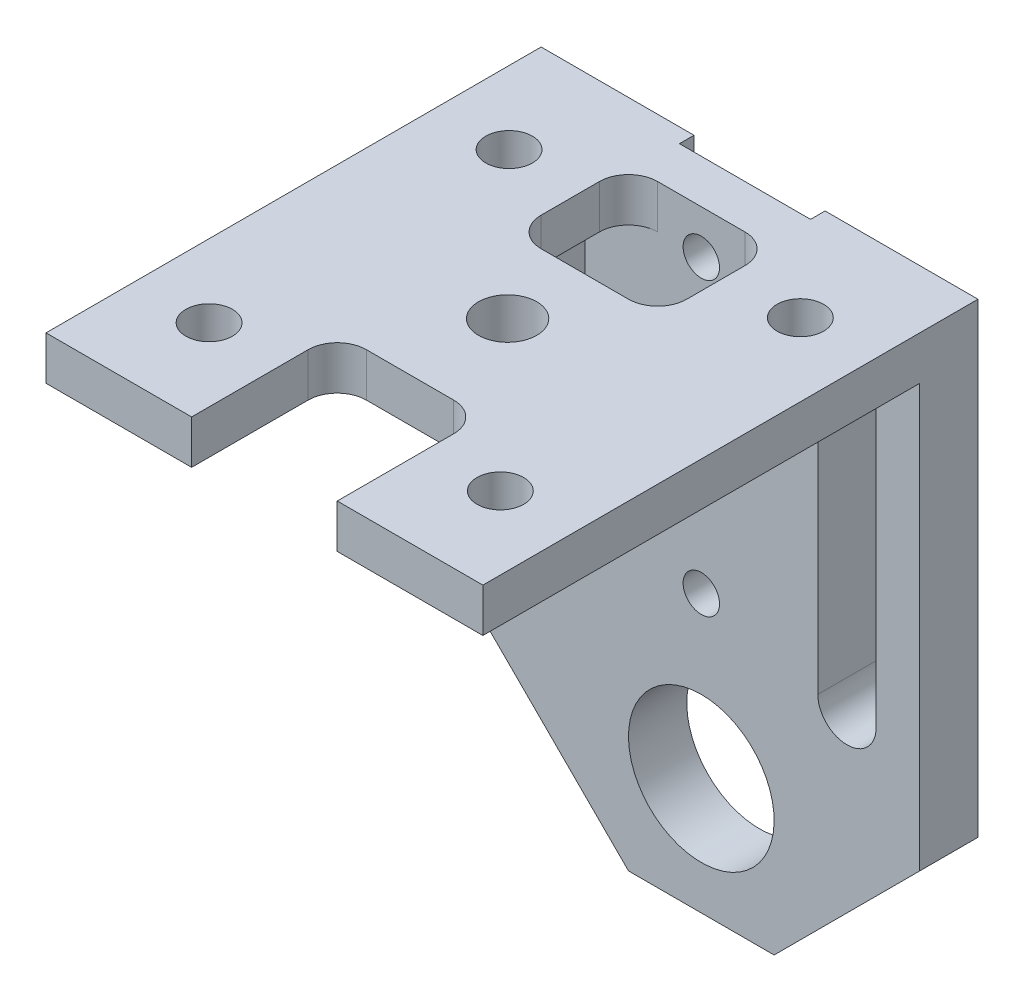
ISO-10303-21;
HEADER;
FILE_DESCRIPTION(('STEP AP214'),'2;1');
FILE_NAME('part.step','',(''),(''),'','','');
FILE_SCHEMA(('AUTOMOTIVE_DESIGN { 1 0 10303 214 1 1 1 1 }'));
ENDSEC;
DATA;
#1=APPLICATION_CONTEXT('core data for automotive mechanical design processes');
#2=APPLICATION_PROTOCOL_DEFINITION('international standard','automotive_design',2000,#1);
#3=PRODUCT_CONTEXT('',#1,'mechanical');
#4=PRODUCT('Part','Part','',(#3));
#5=PRODUCT_RELATED_PRODUCT_CATEGORY('part','',(#4));
#6=PRODUCT_DEFINITION_FORMATION('','',#4);
#7=PRODUCT_DEFINITION_CONTEXT('part definition',#1,'design');
#8=PRODUCT_DEFINITION('design','',#6,#7);
#9=PRODUCT_DEFINITION_SHAPE('','',#8);
#10=(LENGTH_UNIT() NAMED_UNIT(*) SI_UNIT(.MILLI.,.METRE.));
#11=(NAMED_UNIT(*) PLANE_ANGLE_UNIT() SI_UNIT($,.RADIAN.));
#12=(NAMED_UNIT(*) SI_UNIT($,.STERADIAN.) SOLID_ANGLE_UNIT());
#13=UNCERTAINTY_MEASURE_WITH_UNIT(LENGTH_MEASURE(1.E-05),#10,'distance_accuracy_value','');
#14=(GEOMETRIC_REPRESENTATION_CONTEXT(3) GLOBAL_UNCERTAINTY_ASSIGNED_CONTEXT((#13)) GLOBAL_UNIT_ASSIGNED_CONTEXT((#10,
#11,#12)) REPRESENTATION_CONTEXT('',''));
#15=CARTESIAN_POINT('',(0.,0.,0.));
#16=DIRECTION('',(0.,0.,1.));
#17=DIRECTION('',(1.,0.,0.));
#18=AXIS2_PLACEMENT_3D('',#15,#16,#17);
#19=CARTESIAN_POINT('',(30.,0.,0.));
#20=DIRECTION('',(0.,0.,-1.));
#21=DIRECTION('',(-1.,0.,0.));
#22=AXIS2_PLACEMENT_3D('',#19,#20,#21);
#23=PLANE('',#22);
#24=DIRECTION('',(-1.,0.,0.));
#25=VECTOR('',#24,1.);
#26=CARTESIAN_POINT('',(30.,0.,0.));
#27=LINE('',#26,#25);
#28=CARTESIAN_POINT('',(10.,0.,0.));
#29=VERTEX_POINT('',#28);
#30=CARTESIAN_POINT('',(0.,0.,0.));
#31=VERTEX_POINT('',#30);
#32=EDGE_CURVE('E493',#29,#31,#27,.T.);
#33=ORIENTED_EDGE('',*,*,#32,.F.);
#34=DIRECTION('',(0.,1.,0.));
#35=VECTOR('',#34,1.);
#36=CARTESIAN_POINT('',(10.,-39.001,0.));
#37=LINE('',#36,#35);
#38=CARTESIAN_POINT('',(10.,3.,0.));
#39=VERTEX_POINT('',#38);
#40=EDGE_CURVE('E418',#29,#39,#37,.T.);
#41=ORIENTED_EDGE('',*,*,#40,.T.);
#42=DIRECTION('',(-1.,0.,0.));
#43=VECTOR('',#42,1.);
#44=CARTESIAN_POINT('',(30.,3.,0.));
#45=LINE('',#44,#43);
#46=CARTESIAN_POINT('',(0.,3.,0.));
#47=VERTEX_POINT('',#46);
#48=EDGE_CURVE('E466',#39,#47,#45,.T.);
#49=ORIENTED_EDGE('',*,*,#48,.T.);
#50=DIRECTION('',(0.,-1.,0.));
#51=VECTOR('',#50,1.);
#52=CARTESIAN_POINT('',(0.,0.,0.));
#53=LINE('',#52,#51);
#54=EDGE_CURVE('E452',#47,#31,#53,.T.);
#55=ORIENTED_EDGE('',*,*,#54,.T.);
#56=EDGE_LOOP('',(#33,#41,#49,#55));
#57=FACE_BOUND('',#56,.T.);
#58=ADVANCED_FACE('F36',(#57),#23,.F.);
#59=CARTESIAN_POINT('',(30.,3.,0.));
#60=VERTEX_POINT('',#59);
#61=CARTESIAN_POINT('',(20.,3.,0.));
#62=VERTEX_POINT('',#61);
#63=EDGE_CURVE('E478',#60,#62,#45,.T.);
#64=ORIENTED_EDGE('',*,*,#63,.T.);
#65=DIRECTION('',(0.,1.,0.));
#66=VECTOR('',#65,1.);
#67=CARTESIAN_POINT('',(20.,-39.001,0.));
#68=LINE('',#67,#66);
#69=CARTESIAN_POINT('',(20.,0.,0.));
#70=VERTEX_POINT('',#69);
#71=EDGE_CURVE('E417',#70,#62,#68,.T.);
#72=ORIENTED_EDGE('',*,*,#71,.F.);
#73=CARTESIAN_POINT('',(30.,0.,0.));
#74=VERTEX_POINT('',#73);
#75=EDGE_CURVE('E494',#74,#70,#27,.T.);
#76=ORIENTED_EDGE('',*,*,#75,.F.);
#77=DIRECTION('',(0.,-1.,0.));
#78=VECTOR('',#77,1.);
#79=CARTESIAN_POINT('',(30.,0.,0.));
#80=LINE('',#79,#78);
#81=EDGE_CURVE('E453',#60,#74,#80,.T.);
#82=ORIENTED_EDGE('',*,*,#81,.F.);
#83=EDGE_LOOP('',(#64,#72,#76,#82));
#84=FACE_BOUND('',#83,.T.);
#85=ADVANCED_FACE('F647',(#84),#23,.F.);
#86=CARTESIAN_POINT('',(30.,0.,0.));
#87=DIRECTION('',(0.,1.,0.));
#88=DIRECTION('',(0.,0.,1.));
#89=AXIS2_PLACEMENT_3D('',#86,#87,#88);
#90=PLANE('',#89);
#91=CARTESIAN_POINT('',(15.,0.,-16.7));
#92=DIRECTION('',(0.,-1.,0.));
#93=DIRECTION('',(0.,0.,-1.));
#94=AXIS2_PLACEMENT_3D('',#91,#92,#93);
#95=CIRCLE('',#94,2.);
#96=CARTESIAN_POINT('',(15.,0.,-18.7));
#97=VERTEX_POINT('',#96);
#98=EDGE_CURVE('E856',#97,#97,#95,.T.);
#99=ORIENTED_EDGE('',*,*,#98,.F.);
#100=EDGE_LOOP('',(#99));
#101=FACE_BOUND('',#100,.T.);
#102=CARTESIAN_POINT('',(5.,0.,-26.8));
#103=DIRECTION('',(0.,1.,0.));
#104=DIRECTION('',(0.,0.,1.));
#105=AXIS2_PLACEMENT_3D('',#102,#103,#104);
#106=CIRCLE('',#105,1.6);
#107=CARTESIAN_POINT('',(5.,0.,-25.2));
#108=VERTEX_POINT('',#107);
#109=EDGE_CURVE('E425',#108,#108,#106,.T.);
#110=ORIENTED_EDGE('',*,*,#109,.T.);
#111=EDGE_LOOP('',(#110));
#112=FACE_BOUND('',#111,.T.);
#113=CARTESIAN_POINT('',(5.,0.,-6.2));
#114=DIRECTION('',(0.,1.,0.));
#115=DIRECTION('',(0.,0.,1.));
#116=AXIS2_PLACEMENT_3D('',#113,#114,#115);
#117=CIRCLE('',#116,1.6);
#118=CARTESIAN_POINT('',(5.,0.,-4.6));
#119=VERTEX_POINT('',#118);
#120=EDGE_CURVE('E431',#119,#119,#117,.T.);
#121=ORIENTED_EDGE('',*,*,#120,.T.);
#122=EDGE_LOOP('',(#121));
#123=FACE_BOUND('',#122,.T.);
#124=CARTESIAN_POINT('',(25.,0.,-6.2));
#125=DIRECTION('',(0.,1.,0.));
#126=DIRECTION('',(0.,0.,1.));
#127=AXIS2_PLACEMENT_3D('',#124,#125,#126);
#128=CIRCLE('',#127,1.6);
#129=CARTESIAN_POINT('',(25.,0.,-4.6));
#130=VERTEX_POINT('',#129);
#131=EDGE_CURVE('E437',#130,#130,#128,.T.);
#132=ORIENTED_EDGE('',*,*,#131,.T.);
#133=EDGE_LOOP('',(#132));
#134=FACE_BOUND('',#133,.T.);
#135=CARTESIAN_POINT('',(25.,0.,-26.8));
#136=DIRECTION('',(0.,1.,0.));
#137=DIRECTION('',(0.,0.,1.));
#138=AXIS2_PLACEMENT_3D('',#135,#136,#137);
#139=CIRCLE('',#138,1.6);
#140=CARTESIAN_POINT('',(25.,0.,-25.2));
#141=VERTEX_POINT('',#140);
#142=EDGE_CURVE('E443',#141,#141,#139,.T.);
#143=ORIENTED_EDGE('',*,*,#142,.T.);
#144=EDGE_LOOP('',(#143));
#145=FACE_BOUND('',#144,.T.);
#146=DIRECTION('',(-1.,0.,0.));
#147=VECTOR('',#146,1.);
#148=CARTESIAN_POINT('',(15.,0.,-22.));
#149=LINE('',#148,#147);
#150=CARTESIAN_POINT('',(18.,0.,-22.));
#151=VERTEX_POINT('',#150);
#152=CARTESIAN_POINT('',(12.,0.,-22.));
#153=VERTEX_POINT('',#152);
#154=EDGE_CURVE('E360',#151,#153,#149,.T.);
#155=ORIENTED_EDGE('',*,*,#154,.F.);
#156=CARTESIAN_POINT('',(18.,0.,-24.));
#157=DIRECTION('',(0.,1.,0.));
#158=DIRECTION('',(0.,0.,1.));
#159=AXIS2_PLACEMENT_3D('',#156,#157,#158);
#160=CIRCLE('',#159,2.);
#161=CARTESIAN_POINT('',(20.,0.,-24.));
#162=VERTEX_POINT('',#161);
#163=EDGE_CURVE('E530',#151,#162,#160,.T.);
#164=ORIENTED_EDGE('',*,*,#163,.T.);
#165=DIRECTION('',(0.,0.,1.));
#166=VECTOR('',#165,1.);
#167=CARTESIAN_POINT('',(20.,0.,-22.));
#168=LINE('',#167,#166);
#169=CARTESIAN_POINT('',(20.,0.,-28.));
#170=VERTEX_POINT('',#169);
#171=EDGE_CURVE('E358',#170,#162,#168,.T.);
#172=ORIENTED_EDGE('',*,*,#171,.F.);
#173=CARTESIAN_POINT('',(18.,0.,-28.));
#174=DIRECTION('',(0.,1.,0.));
#175=DIRECTION('',(0.,0.,1.));
#176=AXIS2_PLACEMENT_3D('',#173,#174,#175);
#177=CIRCLE('',#176,2.);
#178=CARTESIAN_POINT('',(18.,0.,-30.));
#179=VERTEX_POINT('',#178);
#180=EDGE_CURVE('E555',#170,#179,#177,.T.);
#181=ORIENTED_EDGE('',*,*,#180,.T.);
#182=DIRECTION('',(-1.,0.,0.));
#183=VECTOR('',#182,1.);
#184=CARTESIAN_POINT('',(30.,0.,-30.));
#185=LINE('',#184,#183);
#186=CARTESIAN_POINT('',(30.,0.,-30.));
#187=VERTEX_POINT('',#186);
#188=EDGE_CURVE('E491',#187,#179,#185,.T.);
#189=ORIENTED_EDGE('',*,*,#188,.F.);
#190=DIRECTION('',(0.,0.,-1.));
#191=VECTOR('',#190,1.);
#192=CARTESIAN_POINT('',(30.,0.,0.));
#193=LINE('',#192,#191);
#194=EDGE_CURVE('E456',#74,#187,#193,.T.);
#195=ORIENTED_EDGE('',*,*,#194,.F.);
#196=ORIENTED_EDGE('',*,*,#75,.T.);
#197=DIRECTION('',(0.,0.,1.));
#198=VECTOR('',#197,1.);
#199=CARTESIAN_POINT('',(20.,0.,0.));
#200=LINE('',#199,#198);
#201=CARTESIAN_POINT('',(20.,0.,-8.));
#202=VERTEX_POINT('',#201);
#203=EDGE_CURVE('E399',#202,#70,#200,.T.);
#204=ORIENTED_EDGE('',*,*,#203,.F.);
#205=CARTESIAN_POINT('',(18.,0.,-8.));
#206=DIRECTION('',(0.,1.,0.));
#207=DIRECTION('',(0.,0.,1.));
#208=AXIS2_PLACEMENT_3D('',#205,#206,#207);
#209=CIRCLE('',#208,2.);
#210=CARTESIAN_POINT('',(18.,0.,-10.));
#211=VERTEX_POINT('',#210);
#212=EDGE_CURVE('E566',#202,#211,#209,.T.);
#213=ORIENTED_EDGE('',*,*,#212,.T.);
#214=DIRECTION('',(1.,0.,0.));
#215=VECTOR('',#214,1.);
#216=CARTESIAN_POINT('',(20.,0.,-10.));
#217=LINE('',#216,#215);
#218=CARTESIAN_POINT('',(12.,0.,-9.99999999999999));
#219=VERTEX_POINT('',#218);
#220=EDGE_CURVE('E403',#219,#211,#217,.T.);
#221=ORIENTED_EDGE('',*,*,#220,.F.);
#222=CARTESIAN_POINT('',(12.,0.,-8.));
#223=DIRECTION('',(0.,1.,0.));
#224=DIRECTION('',(0.,0.,1.));
#225=AXIS2_PLACEMENT_3D('',#222,#223,#224);
#226=CIRCLE('',#225,2.);
#227=CARTESIAN_POINT('',(10.,0.,-8.));
#228=VERTEX_POINT('',#227);
#229=EDGE_CURVE('E570',#219,#228,#226,.T.);
#230=ORIENTED_EDGE('',*,*,#229,.T.);
#231=DIRECTION('',(0.,0.,-1.));
#232=VECTOR('',#231,1.);
#233=CARTESIAN_POINT('',(10.,0.,-9.99999999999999));
#234=LINE('',#233,#232);
#235=EDGE_CURVE('E406',#29,#228,#234,.T.);
#236=ORIENTED_EDGE('',*,*,#235,.F.);
#237=ORIENTED_EDGE('',*,*,#32,.T.);
#238=DIRECTION('',(0.,0.,-1.));
#239=VECTOR('',#238,1.);
#240=CARTESIAN_POINT('',(0.,0.,0.));
#241=LINE('',#240,#239);
#242=CARTESIAN_POINT('',(0.,0.,-30.));
#243=VERTEX_POINT('',#242);
#244=EDGE_CURVE('E469',#31,#243,#241,.T.);
#245=ORIENTED_EDGE('',*,*,#244,.T.);
#246=CARTESIAN_POINT('',(12.,0.,-30.));
#247=VERTEX_POINT('',#246);
#248=EDGE_CURVE('E490',#247,#243,#185,.T.);
#249=ORIENTED_EDGE('',*,*,#248,.F.);
#250=CARTESIAN_POINT('',(12.,0.,-28.));
#251=DIRECTION('',(0.,1.,0.));
#252=DIRECTION('',(0.,0.,1.));
#253=AXIS2_PLACEMENT_3D('',#250,#251,#252);
#254=CIRCLE('',#253,2.);
#255=CARTESIAN_POINT('',(10.,0.,-28.));
#256=VERTEX_POINT('',#255);
#257=EDGE_CURVE('E560',#247,#256,#254,.T.);
#258=ORIENTED_EDGE('',*,*,#257,.T.);
#259=DIRECTION('',(0.,0.,-1.));
#260=VECTOR('',#259,1.);
#261=CARTESIAN_POINT('',(10.,0.,-30.));
#262=LINE('',#261,#260);
#263=CARTESIAN_POINT('',(10.,0.,-24.));
#264=VERTEX_POINT('',#263);
#265=EDGE_CURVE('E355',#264,#256,#262,.T.);
#266=ORIENTED_EDGE('',*,*,#265,.F.);
#267=CARTESIAN_POINT('',(12.,0.,-24.));
#268=DIRECTION('',(0.,1.,0.));
#269=DIRECTION('',(0.,0.,1.));
#270=AXIS2_PLACEMENT_3D('',#267,#268,#269);
#271=CIRCLE('',#270,2.);
#272=EDGE_CURVE('E525',#264,#153,#271,.T.);
#273=ORIENTED_EDGE('',*,*,#272,.T.);
#274=EDGE_LOOP('',(#155,#164,#172,#181,#189,#195,#196,#204,#213,#221,#230,#236,#237,#245,#249,
#258,#266,#273));
#275=FACE_BOUND('',#274,.T.);
#276=ADVANCED_FACE('F651',(#101,#112,#123,#134,#145,#275),#90,.F.);
#277=CARTESIAN_POINT('',(30.,0.,-30.));
#278=DIRECTION('',(0.,0.,-1.));
#279=DIRECTION('',(0.,1.,0.));
#280=AXIS2_PLACEMENT_3D('',#277,#278,#279);
#281=PLANE('',#280);
#282=DIRECTION('',(0.,1.,0.));
#283=VECTOR('',#282,1.);
#284=CARTESIAN_POINT('',(3.,0.,-30.));
#285=LINE('',#284,#283);
#286=CARTESIAN_POINT('',(3.,-22.,-30.));
#287=VERTEX_POINT('',#286);
#288=CARTESIAN_POINT('',(3.,-3.,-30.));
#289=VERTEX_POINT('',#288);
#290=EDGE_CURVE('E308',#287,#289,#285,.T.);
#291=ORIENTED_EDGE('',*,*,#290,.T.);
#292=CARTESIAN_POINT('',(5.,-3.,-30.));
#293=DIRECTION('',(0.,0.,-1.));
#294=DIRECTION('',(0.,1.,0.));
#295=AXIS2_PLACEMENT_3D('',#292,#293,#294);
#296=CIRCLE('',#295,2.);
#297=CARTESIAN_POINT('',(7.,-3.,-30.));
#298=VERTEX_POINT('',#297);
#299=EDGE_CURVE('E311',#289,#298,#296,.T.);
#300=ORIENTED_EDGE('',*,*,#299,.T.);
#301=DIRECTION('',(0.,-1.,0.));
#302=VECTOR('',#301,1.);
#303=CARTESIAN_POINT('',(7.,0.,-30.));
#304=LINE('',#303,#302);
#305=CARTESIAN_POINT('',(7.,-22.,-30.));
#306=VERTEX_POINT('',#305);
#307=EDGE_CURVE('E303',#298,#306,#304,.T.);
#308=ORIENTED_EDGE('',*,*,#307,.T.);
#309=CARTESIAN_POINT('',(5.,-22.,-30.));
#310=DIRECTION('',(0.,0.,-1.));
#311=DIRECTION('',(0.,1.,0.));
#312=AXIS2_PLACEMENT_3D('',#309,#310,#311);
#313=CIRCLE('',#312,2.);
#314=EDGE_CURVE('E278',#306,#287,#313,.T.);
#315=ORIENTED_EDGE('',*,*,#314,.T.);
#316=EDGE_LOOP('',(#291,#300,#308,#315));
#317=FACE_BOUND('',#316,.T.);
#318=DIRECTION('',(0.,1.,0.));
#319=VECTOR('',#318,1.);
#320=CARTESIAN_POINT('',(23.,0.,-30.));
#321=LINE('',#320,#319);
#322=CARTESIAN_POINT('',(23.,-22.,-30.));
#323=VERTEX_POINT('',#322);
#324=CARTESIAN_POINT('',(23.,-3.,-30.));
#325=VERTEX_POINT('',#324);
#326=EDGE_CURVE('E340',#323,#325,#321,.T.);
#327=ORIENTED_EDGE('',*,*,#326,.T.);
#328=CARTESIAN_POINT('',(25.,-3.,-30.));
#329=DIRECTION('',(0.,0.,-1.));
#330=DIRECTION('',(0.,1.,0.));
#331=AXIS2_PLACEMENT_3D('',#328,#329,#330);
#332=CIRCLE('',#331,2.);
#333=CARTESIAN_POINT('',(27.,-3.,-30.));
#334=VERTEX_POINT('',#333);
#335=EDGE_CURVE('E343',#325,#334,#332,.T.);
#336=ORIENTED_EDGE('',*,*,#335,.T.);
#337=DIRECTION('',(0.,-1.,0.));
#338=VECTOR('',#337,1.);
#339=CARTESIAN_POINT('',(27.,0.,-30.));
#340=LINE('',#339,#338);
#341=CARTESIAN_POINT('',(27.,-22.,-30.));
#342=VERTEX_POINT('',#341);
#343=EDGE_CURVE('E328',#334,#342,#340,.T.);
#344=ORIENTED_EDGE('',*,*,#343,.T.);
#345=CARTESIAN_POINT('',(25.,-22.,-30.));
#346=DIRECTION('',(0.,0.,-1.));
#347=DIRECTION('',(0.,1.,0.));
#348=AXIS2_PLACEMENT_3D('',#345,#346,#347);
#349=CIRCLE('',#348,2.);
#350=EDGE_CURVE('E337',#342,#323,#349,.T.);
#351=ORIENTED_EDGE('',*,*,#350,.T.);
#352=EDGE_LOOP('',(#327,#336,#344,#351));
#353=FACE_BOUND('',#352,.T.);
#354=DIRECTION('',(-1.,0.,0.));
#355=VECTOR('',#354,1.);
#356=CARTESIAN_POINT('',(30.,-39.,-30.));
#357=LINE('',#356,#355);
#358=CARTESIAN_POINT('',(20.,-39.,-30.));
#359=VERTEX_POINT('',#358);
#360=CARTESIAN_POINT('',(10.,-39.,-30.));
#361=VERTEX_POINT('',#360);
#362=EDGE_CURVE('E488',#359,#361,#357,.T.);
#363=ORIENTED_EDGE('',*,*,#362,.F.);
#364=DIRECTION('',(-0.707106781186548,-0.707106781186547,0.));
#365=VECTOR('',#364,1.);
#366=CARTESIAN_POINT('',(30.,-29.,-30.));
#367=LINE('',#366,#365);
#368=CARTESIAN_POINT('',(30.,-29.,-30.));
#369=VERTEX_POINT('',#368);
#370=EDGE_CURVE('E44',#359,#369,#367,.F.);
#371=ORIENTED_EDGE('',*,*,#370,.T.);
#372=DIRECTION('',(0.,-1.,0.));
#373=VECTOR('',#372,1.);
#374=CARTESIAN_POINT('',(30.,0.,-30.));
#375=LINE('',#374,#373);
#376=EDGE_CURVE('E459',#187,#369,#375,.T.);
#377=ORIENTED_EDGE('',*,*,#376,.F.);
#378=ORIENTED_EDGE('',*,*,#188,.T.);
#379=DIRECTION('',(0.,-1.,0.));
#380=VECTOR('',#379,1.);
#381=CARTESIAN_POINT('',(18.,3.,-30.));
#382=LINE('',#381,#380);
#383=CARTESIAN_POINT('',(18.,3.,-30.));
#384=VERTEX_POINT('',#383);
#385=EDGE_CURVE('E541',#179,#384,#382,.F.);
#386=ORIENTED_EDGE('',*,*,#385,.T.);
#387=DIRECTION('',(-1.,0.,0.));
#388=VECTOR('',#387,1.);
#389=CARTESIAN_POINT('',(20.,3.,-30.));
#390=LINE('',#389,#388);
#391=CARTESIAN_POINT('',(12.,3.,-30.));
#392=VERTEX_POINT('',#391);
#393=EDGE_CURVE('E346',#384,#392,#390,.T.);
#394=ORIENTED_EDGE('',*,*,#393,.T.);
#395=DIRECTION('',(0.,-1.,0.));
#396=VECTOR('',#395,1.);
#397=CARTESIAN_POINT('',(12.,0.,-30.));
#398=LINE('',#397,#396);
#399=EDGE_CURVE('E538',#392,#247,#398,.T.);
#400=ORIENTED_EDGE('',*,*,#399,.T.);
#401=ORIENTED_EDGE('',*,*,#248,.T.);
#402=DIRECTION('',(0.,-1.,0.));
#403=VECTOR('',#402,1.);
#404=CARTESIAN_POINT('',(0.,0.,-30.));
#405=LINE('',#404,#403);
#406=CARTESIAN_POINT('',(0.,-29.,-30.));
#407=VERTEX_POINT('',#406);
#408=EDGE_CURVE('E472',#243,#407,#405,.T.);
#409=ORIENTED_EDGE('',*,*,#408,.T.);
#410=DIRECTION('',(0.707106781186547,-0.707106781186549,0.));
#411=VECTOR('',#410,1.);
#412=CARTESIAN_POINT('',(10.,-39.,-30.));
#413=LINE('',#412,#411);
#414=EDGE_CURVE('E56',#407,#361,#413,.T.);
#415=ORIENTED_EDGE('',*,*,#414,.T.);
#416=EDGE_LOOP('',(#363,#371,#377,#378,#386,#394,#400,#401,#409,#415));
#417=FACE_BOUND('',#416,.T.);
#418=CARTESIAN_POINT('',(15.,-20.,-30.));
#419=DIRECTION('',(0.,0.,-1.));
#420=DIRECTION('',(0.,1.,0.));
#421=AXIS2_PLACEMENT_3D('',#418,#419,#420);
#422=CIRCLE('',#421,1.24999999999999);
#423=CARTESIAN_POINT('',(15.,-18.75,-30.));
#424=VERTEX_POINT('',#423);
#425=EDGE_CURVE('E368',#424,#424,#422,.T.);
#426=ORIENTED_EDGE('',*,*,#425,.T.);
#427=EDGE_LOOP('',(#426));
#428=FACE_BOUND('',#427,.T.);
#429=CARTESIAN_POINT('',(15.,-31.,-30.));
#430=DIRECTION('',(0.,0.,-1.));
#431=DIRECTION('',(0.,1.,0.));
#432=AXIS2_PLACEMENT_3D('',#429,#430,#431);
#433=CIRCLE('',#432,5.);
#434=CARTESIAN_POINT('',(15.,-26.,-30.));
#435=VERTEX_POINT('',#434);
#436=EDGE_CURVE('E449',#435,#435,#433,.T.);
#437=ORIENTED_EDGE('',*,*,#436,.T.);
#438=EDGE_LOOP('',(#437));
#439=FACE_BOUND('',#438,.T.);
#440=CARTESIAN_POINT('',(15.,0.,-30.));
#441=DIRECTION('',(0.,0.,-1.));
#442=DIRECTION('',(0.,1.,0.));
#443=AXIS2_PLACEMENT_3D('',#440,#441,#442);
#444=CIRCLE('',#443,1.24999999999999);
#445=CARTESIAN_POINT('',(15.,1.24999999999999,-30.));
#446=VERTEX_POINT('',#445);
#447=EDGE_CURVE('E374',#446,#446,#444,.T.);
#448=ORIENTED_EDGE('',*,*,#447,.T.);
#449=EDGE_LOOP('',(#448));
#450=FACE_BOUND('',#449,.T.);
#451=ADVANCED_FACE('F586',(#317,#353,#417,#428,#439,#450),#281,.F.);
#452=CARTESIAN_POINT('',(30.,-39.,-34.));
#453=DIRECTION('',(0.,1.,0.));
#454=DIRECTION('',(0.,0.,1.));
#455=AXIS2_PLACEMENT_3D('',#452,#453,#454);
#456=PLANE('',#455);
#457=DIRECTION('',(-1.,0.,0.));
#458=VECTOR('',#457,1.);
#459=CARTESIAN_POINT('',(30.,-39.,-34.));
#460=LINE('',#459,#458);
#461=CARTESIAN_POINT('',(20.,-39.,-34.));
#462=VERTEX_POINT('',#461);
#463=CARTESIAN_POINT('',(10.,-39.,-34.));
#464=VERTEX_POINT('',#463);
#465=EDGE_CURVE('E485',#462,#464,#460,.T.);
#466=ORIENTED_EDGE('',*,*,#465,.F.);
#467=DIRECTION('',(0.,0.,1.));
#468=VECTOR('',#467,1.);
#469=CARTESIAN_POINT('',(20.,-39.,-34.));
#470=LINE('',#469,#468);
#471=EDGE_CURVE('E582',#462,#359,#470,.T.);
#472=ORIENTED_EDGE('',*,*,#471,.T.);
#473=ORIENTED_EDGE('',*,*,#362,.T.);
#474=DIRECTION('',(0.,0.,-1.));
#475=VECTOR('',#474,1.);
#476=CARTESIAN_POINT('',(10.,-39.,-34.));
#477=LINE('',#476,#475);
#478=EDGE_CURVE('E579',#361,#464,#477,.T.);
#479=ORIENTED_EDGE('',*,*,#478,.T.);
#480=EDGE_LOOP('',(#466,#472,#473,#479));
#481=FACE_BOUND('',#480,.T.);
#482=ADVANCED_FACE('F600',(#481),#456,.F.);
#483=CARTESIAN_POINT('',(30.,3.,-34.));
#484=DIRECTION('',(0.,0.,1.));
#485=DIRECTION('',(0.,-1.,0.));
#486=AXIS2_PLACEMENT_3D('',#483,#484,#485);
#487=PLANE('',#486);
#488=DIRECTION('',(0.,-1.,0.));
#489=VECTOR('',#488,1.);
#490=CARTESIAN_POINT('',(7.,-3.,-34.));
#491=LINE('',#490,#489);
#492=CARTESIAN_POINT('',(7.,-3.,-34.));
#493=VERTEX_POINT('',#492);
#494=CARTESIAN_POINT('',(7.,-22.,-34.));
#495=VERTEX_POINT('',#494);
#496=EDGE_CURVE('E286',#493,#495,#491,.T.);
#497=ORIENTED_EDGE('',*,*,#496,.F.);
#498=CARTESIAN_POINT('',(5.,-3.,-34.));
#499=DIRECTION('',(0.,0.,-1.));
#500=DIRECTION('',(0.,1.,0.));
#501=AXIS2_PLACEMENT_3D('',#498,#499,#500);
#502=CIRCLE('',#501,2.);
#503=CARTESIAN_POINT('',(3.,-3.,-34.));
#504=VERTEX_POINT('',#503);
#505=EDGE_CURVE('E291',#504,#493,#502,.T.);
#506=ORIENTED_EDGE('',*,*,#505,.F.);
#507=DIRECTION('',(0.,1.,0.));
#508=VECTOR('',#507,1.);
#509=CARTESIAN_POINT('',(3.,-3.,-34.));
#510=LINE('',#509,#508);
#511=CARTESIAN_POINT('',(3.,-22.,-34.));
#512=VERTEX_POINT('',#511);
#513=EDGE_CURVE('E296',#512,#504,#510,.T.);
#514=ORIENTED_EDGE('',*,*,#513,.F.);
#515=CARTESIAN_POINT('',(5.,-22.,-34.));
#516=DIRECTION('',(0.,0.,-1.));
#517=DIRECTION('',(0.,1.,0.));
#518=AXIS2_PLACEMENT_3D('',#515,#516,#517);
#519=CIRCLE('',#518,2.);
#520=EDGE_CURVE('E275',#495,#512,#519,.T.);
#521=ORIENTED_EDGE('',*,*,#520,.F.);
#522=EDGE_LOOP('',(#497,#506,#514,#521));
#523=FACE_BOUND('',#522,.T.);
#524=DIRECTION('',(0.,-1.,0.));
#525=VECTOR('',#524,1.);
#526=CARTESIAN_POINT('',(27.,-3.,-34.));
#527=LINE('',#526,#525);
#528=CARTESIAN_POINT('',(27.,-3.,-34.));
#529=VERTEX_POINT('',#528);
#530=CARTESIAN_POINT('',(27.,-22.,-34.));
#531=VERTEX_POINT('',#530);
#532=EDGE_CURVE('E316',#529,#531,#527,.T.);
#533=ORIENTED_EDGE('',*,*,#532,.F.);
#534=CARTESIAN_POINT('',(25.,-3.,-34.));
#535=DIRECTION('',(0.,0.,-1.));
#536=DIRECTION('',(0.,-1.,0.));
#537=AXIS2_PLACEMENT_3D('',#534,#535,#536);
#538=CIRCLE('',#537,2.);
#539=CARTESIAN_POINT('',(23.,-3.,-34.));
#540=VERTEX_POINT('',#539);
#541=EDGE_CURVE('E314',#540,#529,#538,.T.);
#542=ORIENTED_EDGE('',*,*,#541,.F.);
#543=DIRECTION('',(0.,1.,0.));
#544=VECTOR('',#543,1.);
#545=CARTESIAN_POINT('',(23.,-3.,-34.));
#546=LINE('',#545,#544);
#547=CARTESIAN_POINT('',(23.,-22.,-34.));
#548=VERTEX_POINT('',#547);
#549=EDGE_CURVE('E322',#548,#540,#546,.T.);
#550=ORIENTED_EDGE('',*,*,#549,.F.);
#551=CARTESIAN_POINT('',(25.,-22.,-34.));
#552=DIRECTION('',(0.,0.,-1.));
#553=DIRECTION('',(0.,-1.,0.));
#554=AXIS2_PLACEMENT_3D('',#551,#552,#553);
#555=CIRCLE('',#554,2.);
#556=EDGE_CURVE('E319',#531,#548,#555,.T.);
#557=ORIENTED_EDGE('',*,*,#556,.F.);
#558=EDGE_LOOP('',(#533,#542,#550,#557));
#559=FACE_BOUND('',#558,.T.);
#560=CARTESIAN_POINT('',(15.,-31.,-34.));
#561=DIRECTION('',(0.,0.,-1.));
#562=DIRECTION('',(0.,1.,0.));
#563=AXIS2_PLACEMENT_3D('',#560,#561,#562);
#564=CIRCLE('',#563,5.);
#565=CARTESIAN_POINT('',(15.,-26.,-34.));
#566=VERTEX_POINT('',#565);
#567=EDGE_CURVE('E446',#566,#566,#564,.T.);
#568=ORIENTED_EDGE('',*,*,#567,.F.);
#569=EDGE_LOOP('',(#568));
#570=FACE_BOUND('',#569,.T.);
#571=DIRECTION('',(0.,1.,0.));
#572=VECTOR('',#571,1.);
#573=CARTESIAN_POINT('',(30.,3.,-34.));
#574=LINE('',#573,#572);
#575=CARTESIAN_POINT('',(30.,-29.,-34.));
#576=VERTEX_POINT('',#575);
#577=CARTESIAN_POINT('',(30.,3.,-34.));
#578=VERTEX_POINT('',#577);
#579=EDGE_CURVE('E462',#576,#578,#574,.T.);
#580=ORIENTED_EDGE('',*,*,#579,.F.);
#581=DIRECTION('',(0.707106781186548,0.707106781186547,0.));
#582=VECTOR('',#581,1.);
#583=CARTESIAN_POINT('',(30.,-29.,-34.));
#584=LINE('',#583,#582);
#585=EDGE_CURVE('E577',#576,#462,#584,.F.);
#586=ORIENTED_EDGE('',*,*,#585,.T.);
#587=ORIENTED_EDGE('',*,*,#465,.T.);
#588=DIRECTION('',(-0.707106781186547,0.707106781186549,0.));
#589=VECTOR('',#588,1.);
#590=CARTESIAN_POINT('',(10.,-39.,-34.));
#591=LINE('',#590,#589);
#592=CARTESIAN_POINT('',(0.,-29.,-34.));
#593=VERTEX_POINT('',#592);
#594=EDGE_CURVE('E575',#464,#593,#591,.T.);
#595=ORIENTED_EDGE('',*,*,#594,.T.);
#596=DIRECTION('',(0.,1.,0.));
#597=VECTOR('',#596,1.);
#598=CARTESIAN_POINT('',(0.,3.,-34.));
#599=LINE('',#598,#597);
#600=CARTESIAN_POINT('',(0.,3.,-34.));
#601=VERTEX_POINT('',#600);
#602=EDGE_CURVE('E474',#593,#601,#599,.T.);
#603=ORIENTED_EDGE('',*,*,#602,.T.);
#604=DIRECTION('',(-1.,0.,0.));
#605=VECTOR('',#604,1.);
#606=CARTESIAN_POINT('',(30.,3.,-34.));
#607=LINE('',#606,#605);
#608=CARTESIAN_POINT('',(10.5,3.,-34.));
#609=VERTEX_POINT('',#608);
#610=EDGE_CURVE('E481',#609,#601,#607,.T.);
#611=ORIENTED_EDGE('',*,*,#610,.F.);
#612=DIRECTION('',(0.,1.,0.));
#613=VECTOR('',#612,1.);
#614=CARTESIAN_POINT('',(10.5,3.,-34.));
#615=LINE('',#614,#613);
#616=CARTESIAN_POINT('',(10.5,-24.,-34.));
#617=VERTEX_POINT('',#616);
#618=EDGE_CURVE('E382',#617,#609,#615,.T.);
#619=ORIENTED_EDGE('',*,*,#618,.F.);
#620=CARTESIAN_POINT('',(11.5,-24.,-34.));
#621=DIRECTION('',(0.,0.,1.));
#622=DIRECTION('',(0.,-1.,0.));
#623=AXIS2_PLACEMENT_3D('',#620,#621,#622);
#624=CIRCLE('',#623,1.);
#625=CARTESIAN_POINT('',(11.5,-25.,-34.));
#626=VERTEX_POINT('',#625);
#627=EDGE_CURVE('E513',#617,#626,#624,.T.);
#628=ORIENTED_EDGE('',*,*,#627,.T.);
#629=DIRECTION('',(-1.,0.,0.));
#630=VECTOR('',#629,1.);
#631=CARTESIAN_POINT('',(19.5,-25.,-34.));
#632=LINE('',#631,#630);
#633=CARTESIAN_POINT('',(18.5,-25.,-34.));
#634=VERTEX_POINT('',#633);
#635=EDGE_CURVE('E393',#634,#626,#632,.T.);
#636=ORIENTED_EDGE('',*,*,#635,.F.);
#637=CARTESIAN_POINT('',(18.5,-24.,-34.));
#638=DIRECTION('',(0.,0.,1.));
#639=DIRECTION('',(0.,-1.,0.));
#640=AXIS2_PLACEMENT_3D('',#637,#638,#639);
#641=CIRCLE('',#640,1.);
#642=CARTESIAN_POINT('',(19.5,-24.,-34.));
#643=VERTEX_POINT('',#642);
#644=EDGE_CURVE('E511',#634,#643,#641,.T.);
#645=ORIENTED_EDGE('',*,*,#644,.T.);
#646=DIRECTION('',(0.,-1.,0.));
#647=VECTOR('',#646,1.);
#648=CARTESIAN_POINT('',(19.5,3.,-34.));
#649=LINE('',#648,#647);
#650=CARTESIAN_POINT('',(19.5,3.,-34.));
#651=VERTEX_POINT('',#650);
#652=EDGE_CURVE('E377',#651,#643,#649,.T.);
#653=ORIENTED_EDGE('',*,*,#652,.F.);
#654=EDGE_CURVE('E482',#578,#651,#607,.T.);
#655=ORIENTED_EDGE('',*,*,#654,.F.);
#656=EDGE_LOOP('',(#580,#586,#587,#595,#603,#611,#619,#628,#636,#645,#653,#655));
#657=FACE_BOUND('',#656,.T.);
#658=ADVANCED_FACE('F293',(#523,#559,#570,#657),#487,.F.);
#659=CARTESIAN_POINT('',(30.,3.,0.));
#660=DIRECTION('',(0.,-1.,0.));
#661=DIRECTION('',(0.,0.,-1.));
#662=AXIS2_PLACEMENT_3D('',#659,#660,#661);
#663=PLANE('',#662);
#664=CARTESIAN_POINT('',(15.,3.,-16.7));
#665=DIRECTION('',(0.,-1.,0.));
#666=DIRECTION('',(0.,0.,-1.));
#667=AXIS2_PLACEMENT_3D('',#664,#665,#666);
#668=CIRCLE('',#667,2.);
#669=CARTESIAN_POINT('',(15.,3.,-18.7));
#670=VERTEX_POINT('',#669);
#671=EDGE_CURVE('E854',#670,#670,#668,.T.);
#672=ORIENTED_EDGE('',*,*,#671,.T.);
#673=EDGE_LOOP('',(#672));
#674=FACE_BOUND('',#673,.T.);
#675=DIRECTION('',(0.,0.,-1.));
#676=VECTOR('',#675,1.);
#677=CARTESIAN_POINT('',(20.,3.,-22.));
#678=LINE('',#677,#676);
#679=CARTESIAN_POINT('',(20.,3.,-24.));
#680=VERTEX_POINT('',#679);
#681=CARTESIAN_POINT('',(20.,3.,-28.));
#682=VERTEX_POINT('',#681);
#683=EDGE_CURVE('E349',#680,#682,#678,.T.);
#684=ORIENTED_EDGE('',*,*,#683,.F.);
#685=CARTESIAN_POINT('',(18.,3.,-24.));
#686=DIRECTION('',(0.,-1.,0.));
#687=DIRECTION('',(0.,0.,-1.));
#688=AXIS2_PLACEMENT_3D('',#685,#686,#687);
#689=CIRCLE('',#688,2.);
#690=CARTESIAN_POINT('',(18.,3.,-22.));
#691=VERTEX_POINT('',#690);
#692=EDGE_CURVE('E533',#680,#691,#689,.T.);
#693=ORIENTED_EDGE('',*,*,#692,.T.);
#694=DIRECTION('',(1.,0.,0.));
#695=VECTOR('',#694,1.);
#696=CARTESIAN_POINT('',(15.,3.,-22.));
#697=LINE('',#696,#695);
#698=CARTESIAN_POINT('',(12.,3.,-22.));
#699=VERTEX_POINT('',#698);
#700=EDGE_CURVE('E352',#699,#691,#697,.T.);
#701=ORIENTED_EDGE('',*,*,#700,.F.);
#702=CARTESIAN_POINT('',(12.,3.,-24.));
#703=DIRECTION('',(0.,-1.,0.));
#704=DIRECTION('',(0.,0.,-1.));
#705=AXIS2_PLACEMENT_3D('',#702,#703,#704);
#706=CIRCLE('',#705,2.);
#707=CARTESIAN_POINT('',(10.,3.,-24.));
#708=VERTEX_POINT('',#707);
#709=EDGE_CURVE('E527',#699,#708,#706,.T.);
#710=ORIENTED_EDGE('',*,*,#709,.T.);
#711=DIRECTION('',(0.,0.,1.));
#712=VECTOR('',#711,1.);
#713=CARTESIAN_POINT('',(10.,3.,-30.));
#714=LINE('',#713,#712);
#715=CARTESIAN_POINT('',(10.,3.,-28.));
#716=VERTEX_POINT('',#715);
#717=EDGE_CURVE('E363',#716,#708,#714,.T.);
#718=ORIENTED_EDGE('',*,*,#717,.F.);
#719=CARTESIAN_POINT('',(12.,3.,-28.));
#720=DIRECTION('',(0.,-1.,0.));
#721=DIRECTION('',(0.,0.,-1.));
#722=AXIS2_PLACEMENT_3D('',#719,#720,#721);
#723=CIRCLE('',#722,2.);
#724=EDGE_CURVE('E562',#716,#392,#723,.T.);
#725=ORIENTED_EDGE('',*,*,#724,.T.);
#726=ORIENTED_EDGE('',*,*,#393,.F.);
#727=CARTESIAN_POINT('',(18.,3.,-28.));
#728=DIRECTION('',(0.,-1.,0.));
#729=DIRECTION('',(0.,0.,-1.));
#730=AXIS2_PLACEMENT_3D('',#727,#728,#729);
#731=CIRCLE('',#730,2.);
#732=EDGE_CURVE('E558',#384,#682,#731,.T.);
#733=ORIENTED_EDGE('',*,*,#732,.T.);
#734=EDGE_LOOP('',(#684,#693,#701,#710,#718,#725,#726,#733));
#735=FACE_BOUND('',#734,.T.);
#736=ORIENTED_EDGE('',*,*,#654,.T.);
#737=DIRECTION('',(0.,0.,-1.));
#738=VECTOR('',#737,1.);
#739=CARTESIAN_POINT('',(19.5,3.,-33.));
#740=LINE('',#739,#738);
#741=CARTESIAN_POINT('',(19.5,3.,-33.));
#742=VERTEX_POINT('',#741);
#743=EDGE_CURVE('E397',#742,#651,#740,.T.);
#744=ORIENTED_EDGE('',*,*,#743,.F.);
#745=DIRECTION('',(1.,0.,0.));
#746=VECTOR('',#745,1.);
#747=CARTESIAN_POINT('',(19.5,3.,-33.));
#748=LINE('',#747,#746);
#749=CARTESIAN_POINT('',(10.5,3.,-33.));
#750=VERTEX_POINT('',#749);
#751=EDGE_CURVE('E387',#750,#742,#748,.T.);
#752=ORIENTED_EDGE('',*,*,#751,.F.);
#753=DIRECTION('',(0.,0.,-1.));
#754=VECTOR('',#753,1.);
#755=CARTESIAN_POINT('',(10.5,3.,-33.));
#756=LINE('',#755,#754);
#757=EDGE_CURVE('E390',#750,#609,#756,.T.);
#758=ORIENTED_EDGE('',*,*,#757,.T.);
#759=ORIENTED_EDGE('',*,*,#610,.T.);
#760=DIRECTION('',(0.,0.,1.));
#761=VECTOR('',#760,1.);
#762=CARTESIAN_POINT('',(0.,3.,0.));
#763=LINE('',#762,#761);
#764=EDGE_CURVE('E457',#601,#47,#763,.T.);
#765=ORIENTED_EDGE('',*,*,#764,.T.);
#766=ORIENTED_EDGE('',*,*,#48,.F.);
#767=DIRECTION('',(0.,0.,1.));
#768=VECTOR('',#767,1.);
#769=CARTESIAN_POINT('',(10.,3.,-9.99999999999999));
#770=LINE('',#769,#768);
#771=CARTESIAN_POINT('',(10.,3.,-8.));
#772=VERTEX_POINT('',#771);
#773=EDGE_CURVE('E415',#772,#39,#770,.T.);
#774=ORIENTED_EDGE('',*,*,#773,.F.);
#775=CARTESIAN_POINT('',(12.,3.,-8.));
#776=DIRECTION('',(0.,-1.,0.));
#777=DIRECTION('',(0.,0.,-1.));
#778=AXIS2_PLACEMENT_3D('',#775,#776,#777);
#779=CIRCLE('',#778,2.);
#780=CARTESIAN_POINT('',(12.,3.,-9.99999999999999));
#781=VERTEX_POINT('',#780);
#782=EDGE_CURVE('E568',#772,#781,#779,.T.);
#783=ORIENTED_EDGE('',*,*,#782,.T.);
#784=DIRECTION('',(-1.,0.,0.));
#785=VECTOR('',#784,1.);
#786=CARTESIAN_POINT('',(20.,3.,-10.));
#787=LINE('',#786,#785);
#788=CARTESIAN_POINT('',(18.,3.,-10.));
#789=VERTEX_POINT('',#788);
#790=EDGE_CURVE('E412',#789,#781,#787,.T.);
#791=ORIENTED_EDGE('',*,*,#790,.F.);
#792=CARTESIAN_POINT('',(18.,3.,-8.));
#793=DIRECTION('',(0.,-1.,0.));
#794=DIRECTION('',(0.,0.,-1.));
#795=AXIS2_PLACEMENT_3D('',#792,#793,#794);
#796=CIRCLE('',#795,2.);
#797=CARTESIAN_POINT('',(20.,3.,-8.));
#798=VERTEX_POINT('',#797);
#799=EDGE_CURVE('E564',#789,#798,#796,.T.);
#800=ORIENTED_EDGE('',*,*,#799,.T.);
#801=DIRECTION('',(0.,0.,-1.));
#802=VECTOR('',#801,1.);
#803=CARTESIAN_POINT('',(20.,3.,0.));
#804=LINE('',#803,#802);
#805=EDGE_CURVE('E409',#62,#798,#804,.T.);
#806=ORIENTED_EDGE('',*,*,#805,.F.);
#807=ORIENTED_EDGE('',*,*,#63,.F.);
#808=DIRECTION('',(0.,0.,1.));
#809=VECTOR('',#808,1.);
#810=CARTESIAN_POINT('',(30.,3.,0.));
#811=LINE('',#810,#809);
#812=EDGE_CURVE('E464',#578,#60,#811,.T.);
#813=ORIENTED_EDGE('',*,*,#812,.F.);
#814=EDGE_LOOP('',(#736,#744,#752,#758,#759,#765,#766,#774,#783,#791,#800,#806,#807,#813));
#815=FACE_BOUND('',#814,.T.);
#816=CARTESIAN_POINT('',(5.,3.,-26.8));
#817=DIRECTION('',(0.,1.,0.));
#818=DIRECTION('',(0.,0.,-1.));
#819=AXIS2_PLACEMENT_3D('',#816,#817,#818);
#820=CIRCLE('',#819,1.6);
#821=CARTESIAN_POINT('',(5.,3.,-28.4));
#822=VERTEX_POINT('',#821);
#823=EDGE_CURVE('E421',#822,#822,#820,.T.);
#824=ORIENTED_EDGE('',*,*,#823,.F.);
#825=EDGE_LOOP('',(#824));
#826=FACE_BOUND('',#825,.T.);
#827=CARTESIAN_POINT('',(5.,3.,-6.2));
#828=DIRECTION('',(0.,1.,0.));
#829=DIRECTION('',(0.,0.,-1.));
#830=AXIS2_PLACEMENT_3D('',#827,#828,#829);
#831=CIRCLE('',#830,1.6);
#832=CARTESIAN_POINT('',(5.,3.,-7.8));
#833=VERTEX_POINT('',#832);
#834=EDGE_CURVE('E428',#833,#833,#831,.T.);
#835=ORIENTED_EDGE('',*,*,#834,.F.);
#836=EDGE_LOOP('',(#835));
#837=FACE_BOUND('',#836,.T.);
#838=CARTESIAN_POINT('',(25.,3.,-6.2));
#839=DIRECTION('',(0.,1.,0.));
#840=DIRECTION('',(0.,0.,1.));
#841=AXIS2_PLACEMENT_3D('',#838,#839,#840);
#842=CIRCLE('',#841,1.6);
#843=CARTESIAN_POINT('',(25.,3.,-4.6));
#844=VERTEX_POINT('',#843);
#845=EDGE_CURVE('E434',#844,#844,#842,.T.);
#846=ORIENTED_EDGE('',*,*,#845,.F.);
#847=EDGE_LOOP('',(#846));
#848=FACE_BOUND('',#847,.T.);
#849=CARTESIAN_POINT('',(25.,3.,-26.8));
#850=DIRECTION('',(0.,1.,0.));
#851=DIRECTION('',(0.,0.,1.));
#852=AXIS2_PLACEMENT_3D('',#849,#850,#851);
#853=CIRCLE('',#852,1.6);
#854=CARTESIAN_POINT('',(25.,3.,-25.2));
#855=VERTEX_POINT('',#854);
#856=EDGE_CURVE('E440',#855,#855,#853,.T.);
#857=ORIENTED_EDGE('',*,*,#856,.F.);
#858=EDGE_LOOP('',(#857));
#859=FACE_BOUND('',#858,.T.);
#860=ADVANCED_FACE('F611',(#674,#735,#815,#826,#837,#848,#859),#663,.F.);
#861=CARTESIAN_POINT('',(30.,0.,0.));
#862=DIRECTION('',(-1.,0.,0.));
#863=DIRECTION('',(0.,0.,1.));
#864=AXIS2_PLACEMENT_3D('',#861,#862,#863);
#865=PLANE('',#864);
#866=ORIENTED_EDGE('',*,*,#376,.T.);
#867=DIRECTION('',(0.,0.,-1.));
#868=VECTOR('',#867,1.);
#869=CARTESIAN_POINT('',(30.,-29.,0.));
#870=LINE('',#869,#868);
#871=EDGE_CURVE('E572',#369,#576,#870,.T.);
#872=ORIENTED_EDGE('',*,*,#871,.T.);
#873=ORIENTED_EDGE('',*,*,#579,.T.);
#874=ORIENTED_EDGE('',*,*,#812,.T.);
#875=ORIENTED_EDGE('',*,*,#81,.T.);
#876=ORIENTED_EDGE('',*,*,#194,.T.);
#877=EDGE_LOOP('',(#866,#872,#873,#874,#875,#876));
#878=FACE_BOUND('',#877,.T.);
#879=ADVANCED_FACE('F592',(#878),#865,.F.);
#880=CARTESIAN_POINT('',(0.,0.,0.));
#881=DIRECTION('',(-1.,0.,0.));
#882=DIRECTION('',(0.,0.,1.));
#883=AXIS2_PLACEMENT_3D('',#880,#881,#882);
#884=PLANE('',#883);
#885=ORIENTED_EDGE('',*,*,#602,.F.);
#886=DIRECTION('',(0.,0.,1.));
#887=VECTOR('',#886,1.);
#888=CARTESIAN_POINT('',(0.,-29.,-30.));
#889=LINE('',#888,#887);
#890=EDGE_CURVE('E11',#593,#407,#889,.T.);
#891=ORIENTED_EDGE('',*,*,#890,.T.);
#892=ORIENTED_EDGE('',*,*,#408,.F.);
#893=ORIENTED_EDGE('',*,*,#244,.F.);
#894=ORIENTED_EDGE('',*,*,#54,.F.);
#895=ORIENTED_EDGE('',*,*,#764,.F.);
#896=EDGE_LOOP('',(#885,#891,#892,#893,#894,#895));
#897=FACE_BOUND('',#896,.T.);
#898=ADVANCED_FACE('F606',(#897),#884,.T.);
#899=CARTESIAN_POINT('',(15.,-31.,-4.00000000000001));
#900=DIRECTION('',(0.,0.,-1.));
#901=DIRECTION('',(0.,1.,0.));
#902=AXIS2_PLACEMENT_3D('',#899,#900,#901);
#903=CYLINDRICAL_SURFACE('',#902,5.);
#904=ORIENTED_EDGE('',*,*,#567,.T.);
#905=EDGE_LOOP('',(#904));
#906=FACE_BOUND('',#905,.T.);
#907=ORIENTED_EDGE('',*,*,#436,.F.);
#908=EDGE_LOOP('',(#907));
#909=FACE_BOUND('',#908,.T.);
#910=ADVANCED_FACE('F814',(#906,#909),#903,.F.);
#911=CARTESIAN_POINT('',(25.,-1.,-26.8));
#912=DIRECTION('',(0.,1.,0.));
#913=DIRECTION('',(0.,0.,1.));
#914=AXIS2_PLACEMENT_3D('',#911,#912,#913);
#915=CYLINDRICAL_SURFACE('',#914,1.6);
#916=ORIENTED_EDGE('',*,*,#856,.T.);
#917=EDGE_LOOP('',(#916));
#918=FACE_BOUND('',#917,.T.);
#919=ORIENTED_EDGE('',*,*,#142,.F.);
#920=EDGE_LOOP('',(#919));
#921=FACE_BOUND('',#920,.T.);
#922=ADVANCED_FACE('F810',(#918,#921),#915,.F.);
#923=CARTESIAN_POINT('',(25.,-1.,-6.2));
#924=DIRECTION('',(0.,1.,0.));
#925=DIRECTION('',(0.,0.,1.));
#926=AXIS2_PLACEMENT_3D('',#923,#924,#925);
#927=CYLINDRICAL_SURFACE('',#926,1.6);
#928=ORIENTED_EDGE('',*,*,#845,.T.);
#929=EDGE_LOOP('',(#928));
#930=FACE_BOUND('',#929,.T.);
#931=ORIENTED_EDGE('',*,*,#131,.F.);
#932=EDGE_LOOP('',(#931));
#933=FACE_BOUND('',#932,.T.);
#934=ADVANCED_FACE('F803',(#930,#933),#927,.F.);
#935=CARTESIAN_POINT('',(5.,-1.,-6.2));
#936=DIRECTION('',(0.,1.,0.));
#937=DIRECTION('',(0.,0.,1.));
#938=AXIS2_PLACEMENT_3D('',#935,#936,#937);
#939=CYLINDRICAL_SURFACE('',#938,1.6);
#940=ORIENTED_EDGE('',*,*,#834,.T.);
#941=EDGE_LOOP('',(#940));
#942=FACE_BOUND('',#941,.T.);
#943=ORIENTED_EDGE('',*,*,#120,.F.);
#944=EDGE_LOOP('',(#943));
#945=FACE_BOUND('',#944,.T.);
#946=ADVANCED_FACE('F798',(#942,#945),#939,.F.);
#947=CARTESIAN_POINT('',(5.,-1.,-26.8));
#948=DIRECTION('',(0.,1.,0.));
#949=DIRECTION('',(0.,0.,1.));
#950=AXIS2_PLACEMENT_3D('',#947,#948,#949);
#951=CYLINDRICAL_SURFACE('',#950,1.6);
#952=ORIENTED_EDGE('',*,*,#823,.T.);
#953=EDGE_LOOP('',(#952));
#954=FACE_BOUND('',#953,.T.);
#955=ORIENTED_EDGE('',*,*,#109,.F.);
#956=EDGE_LOOP('',(#955));
#957=FACE_BOUND('',#956,.T.);
#958=ADVANCED_FACE('F794',(#954,#957),#951,.F.);
#959=CARTESIAN_POINT('',(10.,-39.001,-9.99999999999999));
#960=DIRECTION('',(-1.,0.,0.));
#961=DIRECTION('',(0.,0.,1.));
#962=AXIS2_PLACEMENT_3D('',#959,#960,#961);
#963=PLANE('',#962);
#964=ORIENTED_EDGE('',*,*,#235,.T.);
#965=DIRECTION('',(0.,1.,0.));
#966=VECTOR('',#965,1.);
#967=CARTESIAN_POINT('',(10.,3.,-8.));
#968=LINE('',#967,#966);
#969=EDGE_CURVE('E552',#228,#772,#968,.T.);
#970=ORIENTED_EDGE('',*,*,#969,.T.);
#971=ORIENTED_EDGE('',*,*,#773,.T.);
#972=ORIENTED_EDGE('',*,*,#40,.F.);
#973=EDGE_LOOP('',(#964,#970,#971,#972));
#974=FACE_BOUND('',#973,.T.);
#975=ADVANCED_FACE('F689',(#974),#963,.F.);
#976=CARTESIAN_POINT('',(20.,-39.001,-10.));
#977=DIRECTION('',(0.,0.,-1.));
#978=DIRECTION('',(-1.,0.,0.));
#979=AXIS2_PLACEMENT_3D('',#976,#977,#978);
#980=PLANE('',#979);
#981=ORIENTED_EDGE('',*,*,#220,.T.);
#982=DIRECTION('',(0.,1.,0.));
#983=VECTOR('',#982,1.);
#984=CARTESIAN_POINT('',(18.,3.,-10.));
#985=LINE('',#984,#983);
#986=EDGE_CURVE('E547',#211,#789,#985,.T.);
#987=ORIENTED_EDGE('',*,*,#986,.T.);
#988=ORIENTED_EDGE('',*,*,#790,.T.);
#989=DIRECTION('',(0.,1.,0.));
#990=VECTOR('',#989,1.);
#991=CARTESIAN_POINT('',(12.,0.,-9.99999999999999));
#992=LINE('',#991,#990);
#993=EDGE_CURVE('E545',#781,#219,#992,.F.);
#994=ORIENTED_EDGE('',*,*,#993,.T.);
#995=EDGE_LOOP('',(#981,#987,#988,#994));
#996=FACE_BOUND('',#995,.T.);
#997=ADVANCED_FACE('F698',(#996),#980,.F.);
#998=CARTESIAN_POINT('',(20.,-39.001,0.));
#999=DIRECTION('',(1.,0.,0.));
#1000=DIRECTION('',(0.,0.,-1.));
#1001=AXIS2_PLACEMENT_3D('',#998,#999,#1000);
#1002=PLANE('',#1001);
#1003=ORIENTED_EDGE('',*,*,#805,.T.);
#1004=DIRECTION('',(0.,1.,0.));
#1005=VECTOR('',#1004,1.);
#1006=CARTESIAN_POINT('',(20.,0.,-8.));
#1007=LINE('',#1006,#1005);
#1008=EDGE_CURVE('E550',#798,#202,#1007,.F.);
#1009=ORIENTED_EDGE('',*,*,#1008,.T.);
#1010=ORIENTED_EDGE('',*,*,#203,.T.);
#1011=ORIENTED_EDGE('',*,*,#71,.T.);
#1012=EDGE_LOOP('',(#1003,#1009,#1010,#1011));
#1013=FACE_BOUND('',#1012,.T.);
#1014=ADVANCED_FACE('F704',(#1013),#1002,.F.);
#1015=CARTESIAN_POINT('',(19.5,3.,-33.));
#1016=DIRECTION('',(1.,0.,0.));
#1017=DIRECTION('',(0.,1.,0.));
#1018=AXIS2_PLACEMENT_3D('',#1015,#1016,#1017);
#1019=PLANE('',#1018);
#1020=ORIENTED_EDGE('',*,*,#652,.T.);
#1021=DIRECTION('',(0.,0.,-1.));
#1022=VECTOR('',#1021,1.);
#1023=CARTESIAN_POINT('',(19.5,-24.,-33.));
#1024=LINE('',#1023,#1022);
#1025=CARTESIAN_POINT('',(19.5,-24.,-33.));
#1026=VERTEX_POINT('',#1025);
#1027=EDGE_CURVE('E502',#643,#1026,#1024,.F.);
#1028=ORIENTED_EDGE('',*,*,#1027,.T.);
#1029=DIRECTION('',(0.,-1.,0.));
#1030=VECTOR('',#1029,1.);
#1031=CARTESIAN_POINT('',(19.5,3.,-33.));
#1032=LINE('',#1031,#1030);
#1033=EDGE_CURVE('E378',#742,#1026,#1032,.T.);
#1034=ORIENTED_EDGE('',*,*,#1033,.F.);
#1035=ORIENTED_EDGE('',*,*,#743,.T.);
#1036=EDGE_LOOP('',(#1020,#1028,#1034,#1035));
#1037=FACE_BOUND('',#1036,.T.);
#1038=ADVANCED_FACE('F638',(#1037),#1019,.F.);
#1039=CARTESIAN_POINT('',(10.5,3.,-33.));
#1040=DIRECTION('',(-1.,0.,0.));
#1041=DIRECTION('',(0.,-1.,0.));
#1042=AXIS2_PLACEMENT_3D('',#1039,#1040,#1041);
#1043=PLANE('',#1042);
#1044=DIRECTION('',(0.,1.,0.));
#1045=VECTOR('',#1044,1.);
#1046=CARTESIAN_POINT('',(10.5,3.,-33.));
#1047=LINE('',#1046,#1045);
#1048=CARTESIAN_POINT('',(10.5,-24.,-33.));
#1049=VERTEX_POINT('',#1048);
#1050=EDGE_CURVE('E385',#1049,#750,#1047,.T.);
#1051=ORIENTED_EDGE('',*,*,#1050,.F.);
#1052=DIRECTION('',(0.,0.,-1.));
#1053=VECTOR('',#1052,1.);
#1054=CARTESIAN_POINT('',(10.5,-24.,-34.));
#1055=LINE('',#1054,#1053);
#1056=EDGE_CURVE('E508',#1049,#617,#1055,.T.);
#1057=ORIENTED_EDGE('',*,*,#1056,.T.);
#1058=ORIENTED_EDGE('',*,*,#618,.T.);
#1059=ORIENTED_EDGE('',*,*,#757,.F.);
#1060=EDGE_LOOP('',(#1051,#1057,#1058,#1059));
#1061=FACE_BOUND('',#1060,.T.);
#1062=ADVANCED_FACE('F620',(#1061),#1043,.F.);
#1063=CARTESIAN_POINT('',(19.5,-25.,-33.));
#1064=DIRECTION('',(0.,-1.,0.));
#1065=DIRECTION('',(0.,0.,-1.));
#1066=AXIS2_PLACEMENT_3D('',#1063,#1064,#1065);
#1067=PLANE('',#1066);
#1068=DIRECTION('',(-1.,0.,0.));
#1069=VECTOR('',#1068,1.);
#1070=CARTESIAN_POINT('',(19.5,-25.,-33.));
#1071=LINE('',#1070,#1069);
#1072=CARTESIAN_POINT('',(18.5,-25.,-33.));
#1073=VERTEX_POINT('',#1072);
#1074=CARTESIAN_POINT('',(11.5,-25.,-33.));
#1075=VERTEX_POINT('',#1074);
#1076=EDGE_CURVE('E381',#1073,#1075,#1071,.T.);
#1077=ORIENTED_EDGE('',*,*,#1076,.F.);
#1078=DIRECTION('',(0.,0.,-1.));
#1079=VECTOR('',#1078,1.);
#1080=CARTESIAN_POINT('',(18.5,-25.,-34.));
#1081=LINE('',#1080,#1079);
#1082=EDGE_CURVE('E499',#1073,#634,#1081,.T.);
#1083=ORIENTED_EDGE('',*,*,#1082,.T.);
#1084=ORIENTED_EDGE('',*,*,#635,.T.);
#1085=DIRECTION('',(0.,0.,-1.));
#1086=VECTOR('',#1085,1.);
#1087=CARTESIAN_POINT('',(11.5,-25.,-33.));
#1088=LINE('',#1087,#1086);
#1089=EDGE_CURVE('E497',#626,#1075,#1088,.F.);
#1090=ORIENTED_EDGE('',*,*,#1089,.T.);
#1091=EDGE_LOOP('',(#1077,#1083,#1084,#1090));
#1092=FACE_BOUND('',#1091,.T.);
#1093=ADVANCED_FACE('F628',(#1092),#1067,.F.);
#1094=CARTESIAN_POINT('',(0.,0.,-33.));
#1095=DIRECTION('',(0.,0.,-1.));
#1096=DIRECTION('',(0.,1.,0.));
#1097=AXIS2_PLACEMENT_3D('',#1094,#1095,#1096);
#1098=PLANE('',#1097);
#1099=CARTESIAN_POINT('',(15.,-20.,-33.));
#1100=DIRECTION('',(0.,0.,-1.));
#1101=DIRECTION('',(0.,1.,0.));
#1102=AXIS2_PLACEMENT_3D('',#1099,#1100,#1101);
#1103=CIRCLE('',#1102,1.24999999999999);
#1104=CARTESIAN_POINT('',(15.,-18.75,-33.));
#1105=VERTEX_POINT('',#1104);
#1106=EDGE_CURVE('E365',#1105,#1105,#1103,.T.);
#1107=ORIENTED_EDGE('',*,*,#1106,.F.);
#1108=EDGE_LOOP('',(#1107));
#1109=FACE_BOUND('',#1108,.T.);
#1110=CARTESIAN_POINT('',(15.,0.,-33.));
#1111=DIRECTION('',(0.,0.,-1.));
#1112=DIRECTION('',(0.,1.,0.));
#1113=AXIS2_PLACEMENT_3D('',#1110,#1111,#1112);
#1114=CIRCLE('',#1113,1.24999999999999);
#1115=CARTESIAN_POINT('',(15.,1.25,-33.));
#1116=VERTEX_POINT('',#1115);
#1117=EDGE_CURVE('E371',#1116,#1116,#1114,.T.);
#1118=ORIENTED_EDGE('',*,*,#1117,.F.);
#1119=EDGE_LOOP('',(#1118));
#1120=FACE_BOUND('',#1119,.T.);
#1121=ORIENTED_EDGE('',*,*,#1033,.T.);
#1122=CARTESIAN_POINT('',(18.5,-24.,-33.));
#1123=DIRECTION('',(0.,0.,-1.));
#1124=DIRECTION('',(0.,1.,0.));
#1125=AXIS2_PLACEMENT_3D('',#1122,#1123,#1124);
#1126=CIRCLE('',#1125,1.);
#1127=EDGE_CURVE('E506',#1026,#1073,#1126,.T.);
#1128=ORIENTED_EDGE('',*,*,#1127,.T.);
#1129=ORIENTED_EDGE('',*,*,#1076,.T.);
#1130=CARTESIAN_POINT('',(11.5,-24.,-33.));
#1131=DIRECTION('',(0.,0.,-1.));
#1132=DIRECTION('',(0.,1.,0.));
#1133=AXIS2_PLACEMENT_3D('',#1130,#1131,#1132);
#1134=CIRCLE('',#1133,1.);
#1135=EDGE_CURVE('E504',#1075,#1049,#1134,.T.);
#1136=ORIENTED_EDGE('',*,*,#1135,.T.);
#1137=ORIENTED_EDGE('',*,*,#1050,.T.);
#1138=ORIENTED_EDGE('',*,*,#751,.T.);
#1139=EDGE_LOOP('',(#1121,#1128,#1129,#1136,#1137,#1138));
#1140=FACE_BOUND('',#1139,.T.);
#1141=ADVANCED_FACE('F631',(#1109,#1120,#1140),#1098,.T.);
#1142=CARTESIAN_POINT('',(15.,0.,-33.));
#1143=DIRECTION('',(0.,0.,-1.));
#1144=DIRECTION('',(0.,1.,0.));
#1145=AXIS2_PLACEMENT_3D('',#1142,#1143,#1144);
#1146=CYLINDRICAL_SURFACE('',#1145,1.24999999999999);
#1147=ORIENTED_EDGE('',*,*,#1117,.T.);
#1148=EDGE_LOOP('',(#1147));
#1149=FACE_BOUND('',#1148,.T.);
#1150=ORIENTED_EDGE('',*,*,#447,.F.);
#1151=EDGE_LOOP('',(#1150));
#1152=FACE_BOUND('',#1151,.T.);
#1153=ADVANCED_FACE('F781',(#1149,#1152),#1146,.F.);
#1154=CARTESIAN_POINT('',(15.,-20.,-33.));
#1155=DIRECTION('',(0.,0.,-1.));
#1156=DIRECTION('',(0.,1.,0.));
#1157=AXIS2_PLACEMENT_3D('',#1154,#1155,#1156);
#1158=CYLINDRICAL_SURFACE('',#1157,1.24999999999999);
#1159=ORIENTED_EDGE('',*,*,#1106,.T.);
#1160=EDGE_LOOP('',(#1159));
#1161=FACE_BOUND('',#1160,.T.);
#1162=ORIENTED_EDGE('',*,*,#425,.F.);
#1163=EDGE_LOOP('',(#1162));
#1164=FACE_BOUND('',#1163,.T.);
#1165=ADVANCED_FACE('F724',(#1161,#1164),#1158,.F.);
#1166=CARTESIAN_POINT('',(18.5,-24.,-33.));
#1167=DIRECTION('',(0.,0.,1.));
#1168=DIRECTION('',(0.,-1.,0.));
#1169=AXIS2_PLACEMENT_3D('',#1166,#1167,#1168);
#1170=CYLINDRICAL_SURFACE('',#1169,1.);
#1171=ORIENTED_EDGE('',*,*,#1127,.F.);
#1172=ORIENTED_EDGE('',*,*,#1027,.F.);
#1173=ORIENTED_EDGE('',*,*,#644,.F.);
#1174=ORIENTED_EDGE('',*,*,#1082,.F.);
#1175=EDGE_LOOP('',(#1171,#1172,#1173,#1174));
#1176=FACE_BOUND('',#1175,.T.);
#1177=ADVANCED_FACE('F635',(#1176),#1170,.F.);
#1178=CARTESIAN_POINT('',(11.5,-24.,-33.));
#1179=DIRECTION('',(0.,0.,1.));
#1180=DIRECTION('',(0.,-1.,0.));
#1181=AXIS2_PLACEMENT_3D('',#1178,#1179,#1180);
#1182=CYLINDRICAL_SURFACE('',#1181,1.);
#1183=ORIENTED_EDGE('',*,*,#1135,.F.);
#1184=ORIENTED_EDGE('',*,*,#1089,.F.);
#1185=ORIENTED_EDGE('',*,*,#627,.F.);
#1186=ORIENTED_EDGE('',*,*,#1056,.F.);
#1187=EDGE_LOOP('',(#1183,#1184,#1185,#1186));
#1188=FACE_BOUND('',#1187,.T.);
#1189=ADVANCED_FACE('F624',(#1188),#1182,.F.);
#1190=CARTESIAN_POINT('',(15.,3.001,-22.));
#1191=DIRECTION('',(0.,0.,1.));
#1192=DIRECTION('',(1.,0.,0.));
#1193=AXIS2_PLACEMENT_3D('',#1190,#1191,#1192);
#1194=PLANE('',#1193);
#1195=ORIENTED_EDGE('',*,*,#154,.T.);
#1196=DIRECTION('',(0.,-1.,0.));
#1197=VECTOR('',#1196,1.);
#1198=CARTESIAN_POINT('',(12.,3.,-22.));
#1199=LINE('',#1198,#1197);
#1200=EDGE_CURVE('E521',#153,#699,#1199,.F.);
#1201=ORIENTED_EDGE('',*,*,#1200,.T.);
#1202=ORIENTED_EDGE('',*,*,#700,.T.);
#1203=DIRECTION('',(0.,-1.,0.));
#1204=VECTOR('',#1203,1.);
#1205=CARTESIAN_POINT('',(18.,0.,-22.));
#1206=LINE('',#1205,#1204);
#1207=EDGE_CURVE('E518',#691,#151,#1206,.T.);
#1208=ORIENTED_EDGE('',*,*,#1207,.T.);
#1209=EDGE_LOOP('',(#1195,#1201,#1202,#1208));
#1210=FACE_BOUND('',#1209,.T.);
#1211=ADVANCED_FACE('F675',(#1210),#1194,.F.);
#1212=CARTESIAN_POINT('',(20.,3.001,-22.));
#1213=DIRECTION('',(1.,0.,0.));
#1214=DIRECTION('',(0.,0.,-1.));
#1215=AXIS2_PLACEMENT_3D('',#1212,#1213,#1214);
#1216=PLANE('',#1215);
#1217=ORIENTED_EDGE('',*,*,#683,.T.);
#1218=DIRECTION('',(0.,-1.,0.));
#1219=VECTOR('',#1218,1.);
#1220=CARTESIAN_POINT('',(20.,0.,-28.));
#1221=LINE('',#1220,#1219);
#1222=EDGE_CURVE('E535',#682,#170,#1221,.T.);
#1223=ORIENTED_EDGE('',*,*,#1222,.T.);
#1224=ORIENTED_EDGE('',*,*,#171,.T.);
#1225=DIRECTION('',(0.,-1.,0.));
#1226=VECTOR('',#1225,1.);
#1227=CARTESIAN_POINT('',(20.,3.,-24.));
#1228=LINE('',#1227,#1226);
#1229=EDGE_CURVE('E523',#162,#680,#1228,.F.);
#1230=ORIENTED_EDGE('',*,*,#1229,.T.);
#1231=EDGE_LOOP('',(#1217,#1223,#1224,#1230));
#1232=FACE_BOUND('',#1231,.T.);
#1233=ADVANCED_FACE('F666',(#1232),#1216,.F.);
#1234=CARTESIAN_POINT('',(10.,3.001,-30.));
#1235=DIRECTION('',(-1.,0.,0.));
#1236=DIRECTION('',(0.,0.,1.));
#1237=AXIS2_PLACEMENT_3D('',#1234,#1235,#1236);
#1238=PLANE('',#1237);
#1239=ORIENTED_EDGE('',*,*,#265,.T.);
#1240=DIRECTION('',(0.,-1.,0.));
#1241=VECTOR('',#1240,1.);
#1242=CARTESIAN_POINT('',(10.,3.,-28.));
#1243=LINE('',#1242,#1241);
#1244=EDGE_CURVE('E543',#256,#716,#1243,.F.);
#1245=ORIENTED_EDGE('',*,*,#1244,.T.);
#1246=ORIENTED_EDGE('',*,*,#717,.T.);
#1247=DIRECTION('',(0.,-1.,0.));
#1248=VECTOR('',#1247,1.);
#1249=CARTESIAN_POINT('',(10.,0.,-24.));
#1250=LINE('',#1249,#1248);
#1251=EDGE_CURVE('E515',#708,#264,#1250,.T.);
#1252=ORIENTED_EDGE('',*,*,#1251,.T.);
#1253=EDGE_LOOP('',(#1239,#1245,#1246,#1252));
#1254=FACE_BOUND('',#1253,.T.);
#1255=ADVANCED_FACE('F729',(#1254),#1238,.F.);
#1256=CARTESIAN_POINT('',(12.,3.001,-24.));
#1257=DIRECTION('',(0.,1.,0.));
#1258=DIRECTION('',(0.,0.,1.));
#1259=AXIS2_PLACEMENT_3D('',#1256,#1257,#1258);
#1260=CYLINDRICAL_SURFACE('',#1259,2.);
#1261=ORIENTED_EDGE('',*,*,#709,.F.);
#1262=ORIENTED_EDGE('',*,*,#1200,.F.);
#1263=ORIENTED_EDGE('',*,*,#272,.F.);
#1264=ORIENTED_EDGE('',*,*,#1251,.F.);
#1265=EDGE_LOOP('',(#1261,#1262,#1263,#1264));
#1266=FACE_BOUND('',#1265,.T.);
#1267=ADVANCED_FACE('F678',(#1266),#1260,.F.);
#1268=CARTESIAN_POINT('',(18.,3.001,-24.));
#1269=DIRECTION('',(0.,1.,0.));
#1270=DIRECTION('',(0.,0.,1.));
#1271=AXIS2_PLACEMENT_3D('',#1268,#1269,#1270);
#1272=CYLINDRICAL_SURFACE('',#1271,2.);
#1273=ORIENTED_EDGE('',*,*,#692,.F.);
#1274=ORIENTED_EDGE('',*,*,#1229,.F.);
#1275=ORIENTED_EDGE('',*,*,#163,.F.);
#1276=ORIENTED_EDGE('',*,*,#1207,.F.);
#1277=EDGE_LOOP('',(#1273,#1274,#1275,#1276));
#1278=FACE_BOUND('',#1277,.T.);
#1279=ADVANCED_FACE('F671',(#1278),#1272,.F.);
#1280=CARTESIAN_POINT('',(18.,3.001,-28.));
#1281=DIRECTION('',(0.,1.,0.));
#1282=DIRECTION('',(0.,0.,1.));
#1283=AXIS2_PLACEMENT_3D('',#1280,#1281,#1282);
#1284=CYLINDRICAL_SURFACE('',#1283,2.);
#1285=ORIENTED_EDGE('',*,*,#732,.F.);
#1286=ORIENTED_EDGE('',*,*,#385,.F.);
#1287=ORIENTED_EDGE('',*,*,#180,.F.);
#1288=ORIENTED_EDGE('',*,*,#1222,.F.);
#1289=EDGE_LOOP('',(#1285,#1286,#1287,#1288));
#1290=FACE_BOUND('',#1289,.T.);
#1291=ADVANCED_FACE('F664',(#1290),#1284,.F.);
#1292=CARTESIAN_POINT('',(12.,0.,-28.));
#1293=DIRECTION('',(0.,1.,0.));
#1294=DIRECTION('',(0.,0.,1.));
#1295=AXIS2_PLACEMENT_3D('',#1292,#1293,#1294);
#1296=CYLINDRICAL_SURFACE('',#1295,2.);
#1297=ORIENTED_EDGE('',*,*,#724,.F.);
#1298=ORIENTED_EDGE('',*,*,#1244,.F.);
#1299=ORIENTED_EDGE('',*,*,#257,.F.);
#1300=ORIENTED_EDGE('',*,*,#399,.F.);
#1301=EDGE_LOOP('',(#1297,#1298,#1299,#1300));
#1302=FACE_BOUND('',#1301,.T.);
#1303=ADVANCED_FACE('F683',(#1302),#1296,.F.);
#1304=CARTESIAN_POINT('',(18.,-39.001,-8.));
#1305=DIRECTION('',(0.,-1.,0.));
#1306=DIRECTION('',(0.,0.,-1.));
#1307=AXIS2_PLACEMENT_3D('',#1304,#1305,#1306);
#1308=CYLINDRICAL_SURFACE('',#1307,2.);
#1309=ORIENTED_EDGE('',*,*,#212,.F.);
#1310=ORIENTED_EDGE('',*,*,#1008,.F.);
#1311=ORIENTED_EDGE('',*,*,#799,.F.);
#1312=ORIENTED_EDGE('',*,*,#986,.F.);
#1313=EDGE_LOOP('',(#1309,#1310,#1311,#1312));
#1314=FACE_BOUND('',#1313,.T.);
#1315=ADVANCED_FACE('F701',(#1314),#1308,.F.);
#1316=CARTESIAN_POINT('',(12.,-39.001,-8.));
#1317=DIRECTION('',(0.,-1.,0.));
#1318=DIRECTION('',(0.,0.,-1.));
#1319=AXIS2_PLACEMENT_3D('',#1316,#1317,#1318);
#1320=CYLINDRICAL_SURFACE('',#1319,2.);
#1321=ORIENTED_EDGE('',*,*,#229,.F.);
#1322=ORIENTED_EDGE('',*,*,#993,.F.);
#1323=ORIENTED_EDGE('',*,*,#782,.F.);
#1324=ORIENTED_EDGE('',*,*,#969,.F.);
#1325=EDGE_LOOP('',(#1321,#1322,#1323,#1324));
#1326=FACE_BOUND('',#1325,.T.);
#1327=ADVANCED_FACE('F695',(#1326),#1320,.F.);
#1328=CARTESIAN_POINT('',(25.,-3.,-24.));
#1329=DIRECTION('',(0.,0.,-1.));
#1330=DIRECTION('',(0.,1.,0.));
#1331=AXIS2_PLACEMENT_3D('',#1328,#1329,#1330);
#1332=CYLINDRICAL_SURFACE('',#1331,2.);
#1333=DIRECTION('',(0.,0.,-1.));
#1334=VECTOR('',#1333,1.);
#1335=CARTESIAN_POINT('',(23.,-3.,-24.));
#1336=LINE('',#1335,#1334);
#1337=EDGE_CURVE('E326',#325,#540,#1336,.T.);
#1338=ORIENTED_EDGE('',*,*,#1337,.T.);
#1339=ORIENTED_EDGE('',*,*,#541,.T.);
#1340=DIRECTION('',(0.,0.,-1.));
#1341=VECTOR('',#1340,1.);
#1342=CARTESIAN_POINT('',(27.,-3.,-24.));
#1343=LINE('',#1342,#1341);
#1344=EDGE_CURVE('E325',#334,#529,#1343,.T.);
#1345=ORIENTED_EDGE('',*,*,#1344,.F.);
#1346=ORIENTED_EDGE('',*,*,#335,.F.);
#1347=EDGE_LOOP('',(#1338,#1339,#1345,#1346));
#1348=FACE_BOUND('',#1347,.T.);
#1349=ADVANCED_FACE('F739',(#1348),#1332,.F.);
#1350=CARTESIAN_POINT('',(23.,-3.,-24.));
#1351=DIRECTION('',(-1.,0.,0.));
#1352=DIRECTION('',(0.,-1.,0.));
#1353=AXIS2_PLACEMENT_3D('',#1350,#1351,#1352);
#1354=PLANE('',#1353);
#1355=DIRECTION('',(0.,0.,-1.));
#1356=VECTOR('',#1355,1.);
#1357=CARTESIAN_POINT('',(23.,-22.,-24.));
#1358=LINE('',#1357,#1356);
#1359=EDGE_CURVE('E329',#323,#548,#1358,.T.);
#1360=ORIENTED_EDGE('',*,*,#1359,.T.);
#1361=ORIENTED_EDGE('',*,*,#549,.T.);
#1362=ORIENTED_EDGE('',*,*,#1337,.F.);
#1363=ORIENTED_EDGE('',*,*,#326,.F.);
#1364=EDGE_LOOP('',(#1360,#1361,#1362,#1363));
#1365=FACE_BOUND('',#1364,.T.);
#1366=ADVANCED_FACE('F759',(#1365),#1354,.F.);
#1367=CARTESIAN_POINT('',(25.,-22.,-24.));
#1368=DIRECTION('',(0.,0.,-1.));
#1369=DIRECTION('',(0.,1.,0.));
#1370=AXIS2_PLACEMENT_3D('',#1367,#1368,#1369);
#1371=CYLINDRICAL_SURFACE('',#1370,2.);
#1372=DIRECTION('',(0.,0.,-1.));
#1373=VECTOR('',#1372,1.);
#1374=CARTESIAN_POINT('',(27.,-22.,-24.));
#1375=LINE('',#1374,#1373);
#1376=EDGE_CURVE('E331',#342,#531,#1375,.T.);
#1377=ORIENTED_EDGE('',*,*,#1376,.T.);
#1378=ORIENTED_EDGE('',*,*,#556,.T.);
#1379=ORIENTED_EDGE('',*,*,#1359,.F.);
#1380=ORIENTED_EDGE('',*,*,#350,.F.);
#1381=EDGE_LOOP('',(#1377,#1378,#1379,#1380));
#1382=FACE_BOUND('',#1381,.T.);
#1383=ADVANCED_FACE('F762',(#1382),#1371,.F.);
#1384=CARTESIAN_POINT('',(27.,-3.,-24.));
#1385=DIRECTION('',(1.,0.,0.));
#1386=DIRECTION('',(0.,1.,0.));
#1387=AXIS2_PLACEMENT_3D('',#1384,#1385,#1386);
#1388=PLANE('',#1387);
#1389=ORIENTED_EDGE('',*,*,#1344,.T.);
#1390=ORIENTED_EDGE('',*,*,#532,.T.);
#1391=ORIENTED_EDGE('',*,*,#1376,.F.);
#1392=ORIENTED_EDGE('',*,*,#343,.F.);
#1393=EDGE_LOOP('',(#1389,#1390,#1391,#1392));
#1394=FACE_BOUND('',#1393,.T.);
#1395=ADVANCED_FACE('F757',(#1394),#1388,.F.);
#1396=CARTESIAN_POINT('',(5.,-3.,-24.));
#1397=DIRECTION('',(0.,0.,-1.));
#1398=DIRECTION('',(0.,1.,0.));
#1399=AXIS2_PLACEMENT_3D('',#1396,#1397,#1398);
#1400=CYLINDRICAL_SURFACE('',#1399,2.);
#1401=DIRECTION('',(0.,0.,-1.));
#1402=VECTOR('',#1401,1.);
#1403=CARTESIAN_POINT('',(3.,-3.,-24.));
#1404=LINE('',#1403,#1402);
#1405=EDGE_CURVE('E301',#289,#504,#1404,.T.);
#1406=ORIENTED_EDGE('',*,*,#1405,.T.);
#1407=ORIENTED_EDGE('',*,*,#505,.T.);
#1408=DIRECTION('',(0.,0.,-1.));
#1409=VECTOR('',#1408,1.);
#1410=CARTESIAN_POINT('',(7.,-3.,-24.));
#1411=LINE('',#1410,#1409);
#1412=EDGE_CURVE('E282',#298,#493,#1411,.T.);
#1413=ORIENTED_EDGE('',*,*,#1412,.F.);
#1414=ORIENTED_EDGE('',*,*,#299,.F.);
#1415=EDGE_LOOP('',(#1406,#1407,#1413,#1414));
#1416=FACE_BOUND('',#1415,.T.);
#1417=ADVANCED_FACE('F754',(#1416),#1400,.F.);
#1418=CARTESIAN_POINT('',(3.,-3.,-24.));
#1419=DIRECTION('',(-1.,0.,0.));
#1420=DIRECTION('',(0.,-1.,0.));
#1421=AXIS2_PLACEMENT_3D('',#1418,#1419,#1420);
#1422=PLANE('',#1421);
#1423=DIRECTION('',(0.,0.,-1.));
#1424=VECTOR('',#1423,1.);
#1425=CARTESIAN_POINT('',(3.,-22.,-24.));
#1426=LINE('',#1425,#1424);
#1427=EDGE_CURVE('E281',#287,#512,#1426,.T.);
#1428=ORIENTED_EDGE('',*,*,#1427,.T.);
#1429=ORIENTED_EDGE('',*,*,#513,.T.);
#1430=ORIENTED_EDGE('',*,*,#1405,.F.);
#1431=ORIENTED_EDGE('',*,*,#290,.F.);
#1432=EDGE_LOOP('',(#1428,#1429,#1430,#1431));
#1433=FACE_BOUND('',#1432,.T.);
#1434=ADVANCED_FACE('F750',(#1433),#1422,.F.);
#1435=CARTESIAN_POINT('',(5.,-22.,-24.));
#1436=DIRECTION('',(0.,0.,-1.));
#1437=DIRECTION('',(0.,1.,0.));
#1438=AXIS2_PLACEMENT_3D('',#1435,#1436,#1437);
#1439=CYLINDRICAL_SURFACE('',#1438,2.);
#1440=DIRECTION('',(0.,0.,-1.));
#1441=VECTOR('',#1440,1.);
#1442=CARTESIAN_POINT('',(7.,-22.,-24.));
#1443=LINE('',#1442,#1441);
#1444=EDGE_CURVE('E270',#306,#495,#1443,.T.);
#1445=ORIENTED_EDGE('',*,*,#1444,.T.);
#1446=ORIENTED_EDGE('',*,*,#520,.T.);
#1447=ORIENTED_EDGE('',*,*,#1427,.F.);
#1448=ORIENTED_EDGE('',*,*,#314,.F.);
#1449=EDGE_LOOP('',(#1445,#1446,#1447,#1448));
#1450=FACE_BOUND('',#1449,.T.);
#1451=ADVANCED_FACE('F272',(#1450),#1439,.F.);
#1452=CARTESIAN_POINT('',(7.,-3.,-24.));
#1453=DIRECTION('',(1.,0.,0.));
#1454=DIRECTION('',(0.,1.,0.));
#1455=AXIS2_PLACEMENT_3D('',#1452,#1453,#1454);
#1456=PLANE('',#1455);
#1457=ORIENTED_EDGE('',*,*,#1412,.T.);
#1458=ORIENTED_EDGE('',*,*,#496,.T.);
#1459=ORIENTED_EDGE('',*,*,#1444,.F.);
#1460=ORIENTED_EDGE('',*,*,#307,.F.);
#1461=EDGE_LOOP('',(#1457,#1458,#1459,#1460));
#1462=FACE_BOUND('',#1461,.T.);
#1463=ADVANCED_FACE('F287',(#1462),#1456,.F.);
#1464=CARTESIAN_POINT('',(30.,-29.,0.));
#1465=DIRECTION('',(-0.707106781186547,0.707106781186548,0.));
#1466=DIRECTION('',(0.,0.,-1.));
#1467=AXIS2_PLACEMENT_3D('',#1464,#1465,#1466);
#1468=PLANE('',#1467);
#1469=ORIENTED_EDGE('',*,*,#370,.F.);
#1470=ORIENTED_EDGE('',*,*,#471,.F.);
#1471=ORIENTED_EDGE('',*,*,#585,.F.);
#1472=ORIENTED_EDGE('',*,*,#871,.F.);
#1473=EDGE_LOOP('',(#1469,#1470,#1471,#1472));
#1474=FACE_BOUND('',#1473,.T.);
#1475=ADVANCED_FACE('F595',(#1474),#1468,.F.);
#1476=CARTESIAN_POINT('',(10.,-39.,-34.));
#1477=DIRECTION('',(-0.707106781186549,-0.707106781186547,0.));
#1478=DIRECTION('',(0.,0.,1.));
#1479=AXIS2_PLACEMENT_3D('',#1476,#1477,#1478);
#1480=PLANE('',#1479);
#1481=ORIENTED_EDGE('',*,*,#414,.F.);
#1482=ORIENTED_EDGE('',*,*,#890,.F.);
#1483=ORIENTED_EDGE('',*,*,#594,.F.);
#1484=ORIENTED_EDGE('',*,*,#478,.F.);
#1485=EDGE_LOOP('',(#1481,#1482,#1483,#1484));
#1486=FACE_BOUND('',#1485,.T.);
#1487=ADVANCED_FACE('F38',(#1486),#1480,.T.);
#1488=CARTESIAN_POINT('',(15.,0.,-16.7));
#1489=DIRECTION('',(0.,-1.,0.));
#1490=DIRECTION('',(0.,0.,-1.));
#1491=AXIS2_PLACEMENT_3D('',#1488,#1489,#1490);
#1492=CYLINDRICAL_SURFACE('',#1491,2.);
#1493=ORIENTED_EDGE('',*,*,#671,.F.);
#1494=EDGE_LOOP('',(#1493));
#1495=FACE_BOUND('',#1494,.T.);
#1496=ORIENTED_EDGE('',*,*,#98,.T.);
#1497=EDGE_LOOP('',(#1496));
#1498=FACE_BOUND('',#1497,.T.);
#1499=ADVANCED_FACE('F745',(#1495,#1498),#1492,.F.);
#1500=CLOSED_SHELL('',(#58,#85,#276,#451,#482,#658,#860,#879,#898,#910,#922,#934,#946,#958,#975,
#997,#1014,#1038,#1062,#1093,#1141,#1153,#1165,#1177,#1189,#1211,#1233,#1255,#1267,#1279,#1291,
#1303,#1315,#1327,#1349,#1366,#1383,#1395,#1417,#1434,#1451,#1463,#1475,#1487,#1499));
#1501=MANIFOLD_SOLID_BREP('B2',#1500);
#1502=ADVANCED_BREP_SHAPE_REPRESENTATION('',(#18,#1501),#14);
#1503=SHAPE_DEFINITION_REPRESENTATION(#9,#1502);
ENDSEC;
END-ISO-10303-21;
